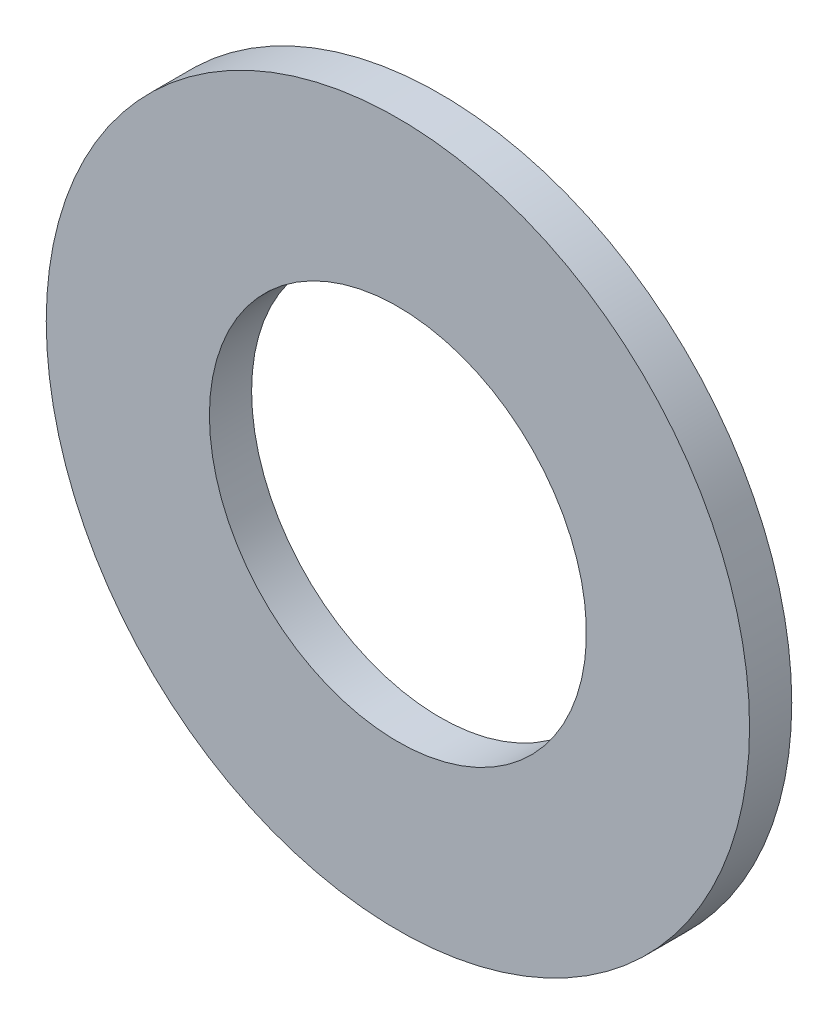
ISO-10303-21;
HEADER;
FILE_DESCRIPTION(('STEP AP214'),'2;1');
FILE_NAME('part.step','',(''),(''),'','','');
FILE_SCHEMA(('AUTOMOTIVE_DESIGN { 1 0 10303 214 1 1 1 1 }'));
ENDSEC;
DATA;
#1=APPLICATION_CONTEXT('core data for automotive mechanical design processes');
#2=APPLICATION_PROTOCOL_DEFINITION('international standard','automotive_design',2000,#1);
#3=PRODUCT_CONTEXT('',#1,'mechanical');
#4=PRODUCT('Part','Part','',(#3));
#5=PRODUCT_RELATED_PRODUCT_CATEGORY('part','',(#4));
#6=PRODUCT_DEFINITION_FORMATION('','',#4);
#7=PRODUCT_DEFINITION_CONTEXT('part definition',#1,'design');
#8=PRODUCT_DEFINITION('design','',#6,#7);
#9=PRODUCT_DEFINITION_SHAPE('','',#8);
#10=(LENGTH_UNIT() NAMED_UNIT(*) SI_UNIT(.MILLI.,.METRE.));
#11=(NAMED_UNIT(*) PLANE_ANGLE_UNIT() SI_UNIT($,.RADIAN.));
#12=(NAMED_UNIT(*) SI_UNIT($,.STERADIAN.) SOLID_ANGLE_UNIT());
#13=UNCERTAINTY_MEASURE_WITH_UNIT(LENGTH_MEASURE(1.E-05),#10,'distance_accuracy_value','');
#14=(GEOMETRIC_REPRESENTATION_CONTEXT(3) GLOBAL_UNCERTAINTY_ASSIGNED_CONTEXT((#13)) GLOBAL_UNIT_ASSIGNED_CONTEXT((#10,
#11,#12)) REPRESENTATION_CONTEXT('',''));
#15=CARTESIAN_POINT('',(0.,0.,0.));
#16=DIRECTION('',(0.,0.,1.));
#17=DIRECTION('',(1.,0.,0.));
#18=AXIS2_PLACEMENT_3D('',#15,#16,#17);
#19=CARTESIAN_POINT('',(0.,0.,0.762));
#20=DIRECTION('',(0.,0.,1.));
#21=DIRECTION('',(1.,0.,0.));
#22=AXIS2_PLACEMENT_3D('',#19,#20,#21);
#23=PLANE('',#22);
#24=CARTESIAN_POINT('',(0.,0.,0.762));
#25=DIRECTION('',(0.,0.,1.));
#26=DIRECTION('',(1.,0.,0.));
#27=AXIS2_PLACEMENT_3D('',#24,#25,#26);
#28=CIRCLE('',#27,6.35);
#29=CARTESIAN_POINT('',(-6.35,0.,0.762));
#30=VERTEX_POINT('',#29);
#31=EDGE_CURVE('E10',#30,#30,#28,.T.);
#32=ORIENTED_EDGE('',*,*,#31,.T.);
#33=EDGE_LOOP('',(#32));
#34=FACE_BOUND('',#33,.T.);
#35=CARTESIAN_POINT('',(0.,0.,0.762));
#36=DIRECTION('',(0.,0.,1.));
#37=DIRECTION('',(1.,0.,0.));
#38=AXIS2_PLACEMENT_3D('',#35,#36,#37);
#39=CIRCLE('',#38,3.4036);
#40=CARTESIAN_POINT('',(-3.4036,0.,0.762));
#41=VERTEX_POINT('',#40);
#42=EDGE_CURVE('E41',#41,#41,#39,.T.);
#43=ORIENTED_EDGE('',*,*,#42,.F.);
#44=EDGE_LOOP('',(#43));
#45=FACE_BOUND('',#44,.T.);
#46=ADVANCED_FACE('F30',(#34,#45),#23,.T.);
#47=CARTESIAN_POINT('',(0.,0.,0.));
#48=DIRECTION('',(0.,0.,1.));
#49=DIRECTION('',(1.,0.,0.));
#50=AXIS2_PLACEMENT_3D('',#47,#48,#49);
#51=PLANE('',#50);
#52=CARTESIAN_POINT('',(0.,0.,0.));
#53=DIRECTION('',(0.,0.,1.));
#54=DIRECTION('',(1.,0.,0.));
#55=AXIS2_PLACEMENT_3D('',#52,#53,#54);
#56=CIRCLE('',#55,6.35);
#57=CARTESIAN_POINT('',(-6.35,0.,0.));
#58=VERTEX_POINT('',#57);
#59=EDGE_CURVE('E34',#58,#58,#56,.T.);
#60=ORIENTED_EDGE('',*,*,#59,.F.);
#61=EDGE_LOOP('',(#60));
#62=FACE_BOUND('',#61,.T.);
#63=CARTESIAN_POINT('',(0.,0.,0.));
#64=DIRECTION('',(0.,0.,1.));
#65=DIRECTION('',(1.,0.,0.));
#66=AXIS2_PLACEMENT_3D('',#63,#64,#65);
#67=CIRCLE('',#66,3.4036);
#68=CARTESIAN_POINT('',(-3.4036,0.,0.));
#69=VERTEX_POINT('',#68);
#70=EDGE_CURVE('E43',#69,#69,#67,.T.);
#71=ORIENTED_EDGE('',*,*,#70,.T.);
#72=EDGE_LOOP('',(#71));
#73=FACE_BOUND('',#72,.T.);
#74=ADVANCED_FACE('F53',(#62,#73),#51,.F.);
#75=CARTESIAN_POINT('',(0.,0.,0.762));
#76=DIRECTION('',(0.,0.,-1.));
#77=DIRECTION('',(-1.,0.,0.));
#78=AXIS2_PLACEMENT_3D('',#75,#76,#77);
#79=CYLINDRICAL_SURFACE('',#78,6.35);
#80=CARTESIAN_POINT('',(-6.35,0.,0.762));
#81=CARTESIAN_POINT('',(-6.35,0.,0.7540625));
#82=CARTESIAN_POINT('',(-6.35,0.,0.746125));
#83=CARTESIAN_POINT('',(-6.35,0.,0.73025));
#84=CARTESIAN_POINT('',(-6.35,0.,0.7223125));
#85=CARTESIAN_POINT('',(-6.35,0.,0.7064375));
#86=CARTESIAN_POINT('',(-6.35,0.,0.6985));
#87=CARTESIAN_POINT('',(-6.35,0.,0.682625));
#88=CARTESIAN_POINT('',(-6.35,0.,0.6746875));
#89=CARTESIAN_POINT('',(-6.35,0.,0.6588125));
#90=CARTESIAN_POINT('',(-6.35,0.,0.650875));
#91=CARTESIAN_POINT('',(-6.35,0.,0.635));
#92=CARTESIAN_POINT('',(-6.35,0.,0.6270625));
#93=CARTESIAN_POINT('',(-6.35,0.,0.6111875));
#94=CARTESIAN_POINT('',(-6.35,0.,0.60325));
#95=CARTESIAN_POINT('',(-6.35,0.,0.587375));
#96=CARTESIAN_POINT('',(-6.35,0.,0.5794375));
#97=CARTESIAN_POINT('',(-6.35,0.,0.5635625));
#98=CARTESIAN_POINT('',(-6.35,0.,0.555625));
#99=CARTESIAN_POINT('',(-6.35,0.,0.53975));
#100=CARTESIAN_POINT('',(-6.35,0.,0.5318125));
#101=CARTESIAN_POINT('',(-6.35,0.,0.5159375));
#102=CARTESIAN_POINT('',(-6.35,0.,0.508));
#103=CARTESIAN_POINT('',(-6.35,0.,0.492125));
#104=CARTESIAN_POINT('',(-6.35,0.,0.4841875));
#105=CARTESIAN_POINT('',(-6.35,0.,0.4683125));
#106=CARTESIAN_POINT('',(-6.35,0.,0.460375));
#107=CARTESIAN_POINT('',(-6.35,0.,0.4445));
#108=CARTESIAN_POINT('',(-6.35,0.,0.4365625));
#109=CARTESIAN_POINT('',(-6.35,0.,0.4206875));
#110=CARTESIAN_POINT('',(-6.35,0.,0.41275));
#111=CARTESIAN_POINT('',(-6.35,0.,0.396875));
#112=CARTESIAN_POINT('',(-6.35,0.,0.3889375));
#113=CARTESIAN_POINT('',(-6.35,0.,0.3730625));
#114=CARTESIAN_POINT('',(-6.35,0.,0.365125));
#115=CARTESIAN_POINT('',(-6.35,0.,0.34925));
#116=CARTESIAN_POINT('',(-6.35,0.,0.3413125));
#117=CARTESIAN_POINT('',(-6.35,0.,0.3254375));
#118=CARTESIAN_POINT('',(-6.35,0.,0.3175));
#119=CARTESIAN_POINT('',(-6.35,0.,0.301625));
#120=CARTESIAN_POINT('',(-6.35,0.,0.2936875));
#121=CARTESIAN_POINT('',(-6.35,0.,0.2778125));
#122=CARTESIAN_POINT('',(-6.35,0.,0.269875));
#123=CARTESIAN_POINT('',(-6.35,0.,0.254));
#124=CARTESIAN_POINT('',(-6.35,0.,0.2460625));
#125=CARTESIAN_POINT('',(-6.35,0.,0.2301875));
#126=CARTESIAN_POINT('',(-6.35,0.,0.22225));
#127=CARTESIAN_POINT('',(-6.35,0.,0.206375));
#128=CARTESIAN_POINT('',(-6.35,0.,0.1984375));
#129=CARTESIAN_POINT('',(-6.35,0.,0.1825625));
#130=CARTESIAN_POINT('',(-6.35,0.,0.174625));
#131=CARTESIAN_POINT('',(-6.35,0.,0.15875));
#132=CARTESIAN_POINT('',(-6.35,0.,0.1508125));
#133=CARTESIAN_POINT('',(-6.35,0.,0.1349375));
#134=CARTESIAN_POINT('',(-6.35,0.,0.127));
#135=CARTESIAN_POINT('',(-6.35,0.,0.111125));
#136=CARTESIAN_POINT('',(-6.35,0.,0.1031875));
#137=CARTESIAN_POINT('',(-6.35,0.,0.0873125));
#138=CARTESIAN_POINT('',(-6.35,0.,0.079375));
#139=CARTESIAN_POINT('',(-6.35,0.,0.0635));
#140=CARTESIAN_POINT('',(-6.35,0.,0.0555625));
#141=CARTESIAN_POINT('',(-6.35,0.,0.0396875));
#142=CARTESIAN_POINT('',(-6.35,0.,0.03175));
#143=CARTESIAN_POINT('',(-6.35,0.,0.015875));
#144=CARTESIAN_POINT('',(-6.35,0.,0.00793749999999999));
#145=CARTESIAN_POINT('',(-6.35,0.,0.));
#146=B_SPLINE_CURVE_WITH_KNOTS('',3,(#80,#81,#82,#83,#84,#85,#86,#87,#88,#89,#90,#91,#92,#93,
#94,#95,#96,#97,#98,#99,#100,#101,#102,#103,#104,#105,#106,#107,#108,#109,#110,#111,#112,#113,
#114,#115,#116,#117,#118,#119,#120,#121,#122,#123,#124,#125,#126,#127,#128,#129,#130,#131,#132,
#133,#134,#135,#136,#137,#138,#139,#140,#141,#142,#143,#144,#145),.UNSPECIFIED.,.F.,.F.,(4,2,2,
2,2,2,2,2,2,2,2,2,2,2,2,2,2,2,2,2,2,2,2,2,2,2,2,2,2,2,2,2,4),(0.,0.0238125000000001,0.047625,
0.0714375,0.0952500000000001,0.1190625,0.142875,0.1666875,0.1905,0.2143125,0.238125,0.2619375,
0.28575,0.3095625,0.333375,0.3571875,0.381,0.4048125,0.428625,0.4524375,0.47625,0.5000625,
0.523875,0.5476875,0.5715,0.5953125,0.619125,0.6429375,0.66675,0.6905625,0.714375,0.7381875,
0.762),.UNSPECIFIED.);
#147=EDGE_CURVE('BSEAM32',#30,#58,#146,.T.);
#148=ORIENTED_EDGE('',*,*,#31,.F.);
#149=ORIENTED_EDGE('',*,*,#59,.T.);
#150=ORIENTED_EDGE('',*,*,#147,.T.);
#151=ORIENTED_EDGE('',*,*,#147,.F.);
#152=EDGE_LOOP('',(#148,#150,#149,#151));
#153=FACE_BOUND('',#152,.T.);
#154=ADVANCED_FACE('F32',(#153),#79,.T.);
#155=CARTESIAN_POINT('',(0.,0.,0.762));
#156=DIRECTION('',(0.,0.,-1.));
#157=DIRECTION('',(-1.,0.,0.));
#158=AXIS2_PLACEMENT_3D('',#155,#156,#157);
#159=CYLINDRICAL_SURFACE('',#158,3.4036);
#160=CARTESIAN_POINT('',(-3.4036,0.,0.762));
#161=CARTESIAN_POINT('',(-3.4036,0.,0.7540625));
#162=CARTESIAN_POINT('',(-3.4036,0.,0.746125));
#163=CARTESIAN_POINT('',(-3.4036,0.,0.73025));
#164=CARTESIAN_POINT('',(-3.4036,0.,0.7223125));
#165=CARTESIAN_POINT('',(-3.4036,0.,0.7064375));
#166=CARTESIAN_POINT('',(-3.4036,0.,0.6985));
#167=CARTESIAN_POINT('',(-3.4036,0.,0.682625));
#168=CARTESIAN_POINT('',(-3.4036,0.,0.6746875));
#169=CARTESIAN_POINT('',(-3.4036,0.,0.6588125));
#170=CARTESIAN_POINT('',(-3.4036,0.,0.650875));
#171=CARTESIAN_POINT('',(-3.4036,0.,0.635));
#172=CARTESIAN_POINT('',(-3.4036,0.,0.6270625));
#173=CARTESIAN_POINT('',(-3.4036,0.,0.6111875));
#174=CARTESIAN_POINT('',(-3.4036,0.,0.60325));
#175=CARTESIAN_POINT('',(-3.4036,0.,0.587375));
#176=CARTESIAN_POINT('',(-3.4036,0.,0.5794375));
#177=CARTESIAN_POINT('',(-3.4036,0.,0.5635625));
#178=CARTESIAN_POINT('',(-3.4036,0.,0.555625));
#179=CARTESIAN_POINT('',(-3.4036,0.,0.53975));
#180=CARTESIAN_POINT('',(-3.4036,0.,0.5318125));
#181=CARTESIAN_POINT('',(-3.4036,0.,0.5159375));
#182=CARTESIAN_POINT('',(-3.4036,0.,0.508));
#183=CARTESIAN_POINT('',(-3.4036,0.,0.492125));
#184=CARTESIAN_POINT('',(-3.4036,0.,0.4841875));
#185=CARTESIAN_POINT('',(-3.4036,0.,0.4683125));
#186=CARTESIAN_POINT('',(-3.4036,0.,0.460375));
#187=CARTESIAN_POINT('',(-3.4036,0.,0.4445));
#188=CARTESIAN_POINT('',(-3.4036,0.,0.4365625));
#189=CARTESIAN_POINT('',(-3.4036,0.,0.4206875));
#190=CARTESIAN_POINT('',(-3.4036,0.,0.41275));
#191=CARTESIAN_POINT('',(-3.4036,0.,0.396875));
#192=CARTESIAN_POINT('',(-3.4036,0.,0.3889375));
#193=CARTESIAN_POINT('',(-3.4036,0.,0.3730625));
#194=CARTESIAN_POINT('',(-3.4036,0.,0.365125));
#195=CARTESIAN_POINT('',(-3.4036,0.,0.34925));
#196=CARTESIAN_POINT('',(-3.4036,0.,0.3413125));
#197=CARTESIAN_POINT('',(-3.4036,0.,0.3254375));
#198=CARTESIAN_POINT('',(-3.4036,0.,0.3175));
#199=CARTESIAN_POINT('',(-3.4036,0.,0.301625));
#200=CARTESIAN_POINT('',(-3.4036,0.,0.2936875));
#201=CARTESIAN_POINT('',(-3.4036,0.,0.2778125));
#202=CARTESIAN_POINT('',(-3.4036,0.,0.269875));
#203=CARTESIAN_POINT('',(-3.4036,0.,0.254));
#204=CARTESIAN_POINT('',(-3.4036,0.,0.2460625));
#205=CARTESIAN_POINT('',(-3.4036,0.,0.2301875));
#206=CARTESIAN_POINT('',(-3.4036,0.,0.22225));
#207=CARTESIAN_POINT('',(-3.4036,0.,0.206375));
#208=CARTESIAN_POINT('',(-3.4036,0.,0.1984375));
#209=CARTESIAN_POINT('',(-3.4036,0.,0.1825625));
#210=CARTESIAN_POINT('',(-3.4036,0.,0.174625));
#211=CARTESIAN_POINT('',(-3.4036,0.,0.15875));
#212=CARTESIAN_POINT('',(-3.4036,0.,0.1508125));
#213=CARTESIAN_POINT('',(-3.4036,0.,0.1349375));
#214=CARTESIAN_POINT('',(-3.4036,0.,0.127));
#215=CARTESIAN_POINT('',(-3.4036,0.,0.111125));
#216=CARTESIAN_POINT('',(-3.4036,0.,0.1031875));
#217=CARTESIAN_POINT('',(-3.4036,0.,0.0873125));
#218=CARTESIAN_POINT('',(-3.4036,0.,0.079375));
#219=CARTESIAN_POINT('',(-3.4036,0.,0.0635));
#220=CARTESIAN_POINT('',(-3.4036,0.,0.0555625));
#221=CARTESIAN_POINT('',(-3.4036,0.,0.0396875));
#222=CARTESIAN_POINT('',(-3.4036,0.,0.03175));
#223=CARTESIAN_POINT('',(-3.4036,0.,0.015875));
#224=CARTESIAN_POINT('',(-3.4036,0.,0.00793749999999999));
#225=CARTESIAN_POINT('',(-3.4036,0.,0.));
#226=B_SPLINE_CURVE_WITH_KNOTS('',3,(#160,#161,#162,#163,#164,#165,#166,#167,#168,#169,#170,
#171,#172,#173,#174,#175,#176,#177,#178,#179,#180,#181,#182,#183,#184,#185,#186,#187,#188,#189,
#190,#191,#192,#193,#194,#195,#196,#197,#198,#199,#200,#201,#202,#203,#204,#205,#206,#207,#208,
#209,#210,#211,#212,#213,#214,#215,#216,#217,#218,#219,#220,#221,#222,#223,#224,#225),
.UNSPECIFIED.,.F.,.F.,(4,2,2,2,2,2,2,2,2,2,2,2,2,2,2,2,2,2,2,2,2,2,2,2,2,2,2,2,2,2,2,2,4),(0.,
0.0238125,0.0476249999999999,0.0714374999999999,0.09525,0.1190625,0.142875,0.1666875,0.1905,
0.2143125,0.238125,0.2619375,0.28575,0.3095625,0.333375,0.3571875,0.381,0.4048125,0.428625,
0.4524375,0.47625,0.5000625,0.523875,0.5476875,0.5715,0.5953125,0.619125,0.6429375,0.66675,
0.6905625,0.714375,0.7381875,0.762),.UNSPECIFIED.);
#227=EDGE_CURVE('BSEAM49',#41,#69,#226,.T.);
#228=ORIENTED_EDGE('',*,*,#42,.T.);
#229=ORIENTED_EDGE('',*,*,#70,.F.);
#230=ORIENTED_EDGE('',*,*,#227,.T.);
#231=ORIENTED_EDGE('',*,*,#227,.F.);
#232=EDGE_LOOP('',(#228,#230,#229,#231));
#233=FACE_BOUND('',#232,.T.);
#234=ADVANCED_FACE('F49',(#233),#159,.F.);
#235=CLOSED_SHELL('',(#46,#74,#154,#234));
#236=MANIFOLD_SOLID_BREP('B2',#235);
#237=ADVANCED_BREP_SHAPE_REPRESENTATION('',(#18,#236),#14);
#238=SHAPE_DEFINITION_REPRESENTATION(#9,#237);
ENDSEC;
END-ISO-10303-21;
